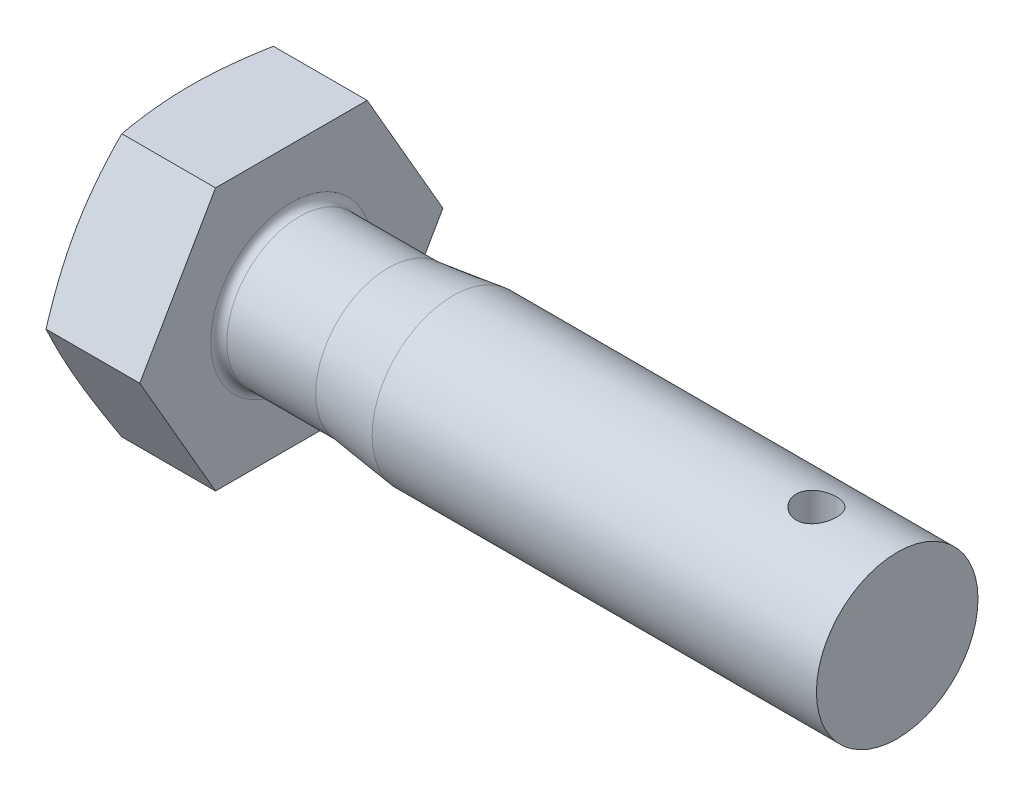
ISO-10303-21;
HEADER;
FILE_DESCRIPTION(('STEP AP214'),'2;1');
FILE_NAME('part.step','',(''),(''),'','','');
FILE_SCHEMA(('AUTOMOTIVE_DESIGN { 1 0 10303 214 1 1 1 1 }'));
ENDSEC;
DATA;
#1=APPLICATION_CONTEXT('core data for automotive mechanical design processes');
#2=APPLICATION_PROTOCOL_DEFINITION('international standard','automotive_design',2000,#1);
#3=PRODUCT_CONTEXT('',#1,'mechanical');
#4=PRODUCT('Part','Part','',(#3));
#5=PRODUCT_RELATED_PRODUCT_CATEGORY('part','',(#4));
#6=PRODUCT_DEFINITION_FORMATION('','',#4);
#7=PRODUCT_DEFINITION_CONTEXT('part definition',#1,'design');
#8=PRODUCT_DEFINITION('design','',#6,#7);
#9=PRODUCT_DEFINITION_SHAPE('','',#8);
#10=(LENGTH_UNIT() NAMED_UNIT(*) SI_UNIT(.MILLI.,.METRE.));
#11=(NAMED_UNIT(*) PLANE_ANGLE_UNIT() SI_UNIT($,.RADIAN.));
#12=(NAMED_UNIT(*) SI_UNIT($,.STERADIAN.) SOLID_ANGLE_UNIT());
#13=UNCERTAINTY_MEASURE_WITH_UNIT(LENGTH_MEASURE(1.E-05),#10,'distance_accuracy_value','');
#14=(GEOMETRIC_REPRESENTATION_CONTEXT(3) GLOBAL_UNCERTAINTY_ASSIGNED_CONTEXT((#13)) GLOBAL_UNIT_ASSIGNED_CONTEXT((#10,
#11,#12)) REPRESENTATION_CONTEXT('',''));
#15=CARTESIAN_POINT('',(0.,0.,0.));
#16=DIRECTION('',(0.,0.,1.));
#17=DIRECTION('',(1.,0.,0.));
#18=AXIS2_PLACEMENT_3D('',#15,#16,#17);
#19=CARTESIAN_POINT('',(0.,-6.49999999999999,-11.2583302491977));
#20=DIRECTION('',(1.,0.,0.));
#21=DIRECTION('',(0.,0.,-1.));
#22=AXIS2_PLACEMENT_3D('',#19,#20,#21);
#23=PLANE('',#22);
#24=CARTESIAN_POINT('',(0.,0.,0.));
#25=DIRECTION('',(-1.,0.,0.));
#26=DIRECTION('',(0.,0.,1.));
#27=AXIS2_PLACEMENT_3D('',#24,#25,#26);
#28=CIRCLE('',#27,5.7);
#29=CARTESIAN_POINT('',(0.,0.,5.7));
#30=VERTEX_POINT('',#29);
#31=EDGE_CURVE('E97',#30,#30,#28,.T.);
#32=ORIENTED_EDGE('',*,*,#31,.T.);
#33=EDGE_LOOP('',(#32));
#34=FACE_BOUND('',#33,.T.);
#35=CARTESIAN_POINT('',(0.,0.,0.));
#36=DIRECTION('',(1.,0.,0.));
#37=DIRECTION('',(0.,0.,-1.));
#38=AXIS2_PLACEMENT_3D('',#35,#36,#37);
#39=CIRCLE('',#38,4.6);
#40=CARTESIAN_POINT('',(0.,0.,-4.6));
#41=VERTEX_POINT('',#40);
#42=EDGE_CURVE('E230',#41,#41,#39,.T.);
#43=ORIENTED_EDGE('',*,*,#42,.T.);
#44=EDGE_LOOP('',(#43));
#45=FACE_BOUND('',#44,.T.);
#46=ADVANCED_FACE('F32',(#34,#45),#23,.F.);
#47=CARTESIAN_POINT('',(5.3,-6.5,3.75277674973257));
#48=DIRECTION('',(0.,1.,0.));
#49=DIRECTION('',(0.,0.,1.));
#50=AXIS2_PLACEMENT_3D('',#47,#48,#49);
#51=PLANE('',#50);
#52=CARTESIAN_POINT('',(2.23845243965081,-6.49999999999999,-9.90832031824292));
#53=CARTESIAN_POINT('',(2.14906495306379,-6.49999999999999,-9.61451823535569));
#54=CARTESIAN_POINT('',(2.06072666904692,-6.49999999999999,-9.32039096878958));
#55=CARTESIAN_POINT('',(1.88672902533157,-6.49999999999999,-8.73132057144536));
#56=CARTESIAN_POINT('',(1.80106987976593,-6.49999999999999,-8.43637737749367));
#57=CARTESIAN_POINT('',(1.63286685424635,-6.49999999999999,-7.84499875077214));
#58=CARTESIAN_POINT('',(1.55032916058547,-6.49999999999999,-7.54856155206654));
#59=CARTESIAN_POINT('',(1.38934256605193,-6.49999999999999,-6.95458050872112));
#60=CARTESIAN_POINT('',(1.31089359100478,-6.49999999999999,-6.65703668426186));
#61=CARTESIAN_POINT('',(1.16004648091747,-6.49999999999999,-6.06437621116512));
#62=CARTESIAN_POINT('',(1.08758490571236,-6.5,-5.76927579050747));
#63=CARTESIAN_POINT('',(0.948872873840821,-6.5,-5.17760339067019));
#64=CARTESIAN_POINT('',(0.882622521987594,-6.5,-4.88103138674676));
#65=CARTESIAN_POINT('',(0.757886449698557,-6.5,-4.28635449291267));
#66=CARTESIAN_POINT('',(0.699397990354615,-6.5,-3.98825018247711));
#67=CARTESIAN_POINT('',(0.591974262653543,-6.5,-3.39031237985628));
#68=CARTESIAN_POINT('',(0.543038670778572,-6.5,-3.09047894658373));
#69=CARTESIAN_POINT('',(0.461562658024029,-6.5,-2.52289407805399));
#70=CARTESIAN_POINT('',(0.427798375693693,-6.5,-2.25531997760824));
#71=CARTESIAN_POINT('',(0.370735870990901,-6.5,-1.71904882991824));
#72=CARTESIAN_POINT('',(0.347437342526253,-6.5,-1.45035181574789));
#73=CARTESIAN_POINT('',(0.312428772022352,-6.5,-0.912380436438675));
#74=CARTESIAN_POINT('',(0.300710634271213,-6.5,-0.643106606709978));
#75=CARTESIAN_POINT('',(0.289455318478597,-6.5,-0.104301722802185));
#76=CARTESIAN_POINT('',(0.289918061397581,-6.5,0.165229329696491));
#77=CARTESIAN_POINT('',(0.303033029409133,-6.5,0.705381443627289));
#78=CARTESIAN_POINT('',(0.315748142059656,-6.5,0.976000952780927));
#79=CARTESIAN_POINT('',(0.352783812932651,-6.5,1.51643777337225));
#80=CARTESIAN_POINT('',(0.377104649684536,-6.5,1.78625506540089));
#81=CARTESIAN_POINT('',(0.436219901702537,-6.5,2.32495734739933));
#82=CARTESIAN_POINT('',(0.471023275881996,-6.5,2.59384134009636));
#83=CARTESIAN_POINT('',(0.549699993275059,-6.5,3.13026390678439));
#84=CARTESIAN_POINT('',(0.593573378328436,-6.5,3.39780247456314));
#85=CARTESIAN_POINT('',(0.691934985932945,-6.5,3.94808111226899));
#86=CARTESIAN_POINT('',(0.74691338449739,-6.5,4.23073279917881));
#87=CARTESIAN_POINT('',(0.86394903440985,-6.5,4.79457620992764));
#88=CARTESIAN_POINT('',(0.926006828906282,-6.5,5.07576782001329));
#89=CARTESIAN_POINT('',(1.05588818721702,-6.5,5.63689575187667));
#90=CARTESIAN_POINT('',(1.12371345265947,-6.5,5.91683167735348));
#91=CARTESIAN_POINT('',(1.26402052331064,-6.5,6.47552108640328));
#92=CARTESIAN_POINT('',(1.33650221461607,-6.5,6.75427459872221));
#93=CARTESIAN_POINT('',(1.48534113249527,-6.5,7.31112718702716));
#94=CARTESIAN_POINT('',(1.56170324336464,-6.5,7.58922495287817));
#95=CARTESIAN_POINT('',(1.71752308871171,-6.5,8.14455350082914));
#96=CARTESIAN_POINT('',(1.79698086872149,-6.5,8.4217842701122));
#97=CARTESIAN_POINT('',(2.03910477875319,-6.5,9.25227183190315));
#98=CARTESIAN_POINT('',(2.20554932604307,-6.5,9.80442629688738));
#99=CARTESIAN_POINT('',(2.54338122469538,-6.5,10.9002631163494));
#100=CARTESIAN_POINT('',(2.7146898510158,-6.5,11.4439699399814));
#101=CARTESIAN_POINT('',(3.06213112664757,-6.5,12.5298660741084));
#102=CARTESIAN_POINT('',(3.23826401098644,-6.5,13.0720553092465));
#103=CARTESIAN_POINT('',(3.59337406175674,-6.5,14.1532106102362));
#104=CARTESIAN_POINT('',(3.77233783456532,-6.5,14.6921810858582));
#105=CARTESIAN_POINT('',(4.0427494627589,-6.5,15.4999530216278));
#106=CARTESIAN_POINT('',(4.13321063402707,-6.5,15.7690854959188));
#107=CARTESIAN_POINT('',(4.31471234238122,-6.5,16.3071543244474));
#108=CARTESIAN_POINT('',(4.40575287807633,-6.5,16.5760906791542));
#109=CARTESIAN_POINT('',(4.49704417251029,-6.5,16.8449418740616));
#110=B_SPLINE_CURVE_WITH_KNOTS('',3,(#52,#53,#54,#55,#56,#57,#58,#59,#60,#61,#62,#63,#64,#65,
#66,#67,#68,#69,#70,#71,#72,#73,#74,#75,#76,#77,#78,#79,#80,#81,#82,#83,#84,#85,#86,#87,#88,#89,
#90,#91,#92,#93,#94,#95,#96,#97,#98,#99,#100,#101,#102,#103,#104,#105,#106,#107,#108,#109),
.UNSPECIFIED.,.F.,.F.,(4,2,2,2,2,2,2,2,2,2,2,2,2,2,2,2,2,2,2,2,2,2,2,2,2,2,2,2,4),(0.,
0.921303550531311,1.84268054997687,2.76579693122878,3.68889656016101,4.60044337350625,
5.51200556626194,6.42324523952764,7.33445404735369,8.14336365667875,8.95224960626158,
9.76056967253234,10.5688844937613,11.3813703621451,12.1938757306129,13.0070774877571,
13.8202829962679,14.6840182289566,15.5478197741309,16.4118770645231,17.275913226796,
18.1410652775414,19.0062300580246,20.736241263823,22.4463828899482,24.1566079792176,
25.8603170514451,26.7121026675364,27.5638862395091),.UNSPECIFIED.);
#111=CARTESIAN_POINT('',(0.657167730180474,-6.5,-3.75277674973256));
#112=VERTEX_POINT('',#111);
#113=CARTESIAN_POINT('',(0.657167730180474,-6.5,3.75277674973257));
#114=VERTEX_POINT('',#113);
#115=EDGE_CURVE('E54',#112,#114,#110,.T.);
#116=ORIENTED_EDGE('',*,*,#115,.F.);
#117=DIRECTION('',(-1.,0.,0.));
#118=VECTOR('',#117,1.);
#119=CARTESIAN_POINT('',(5.3,-6.5,-3.75277674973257));
#120=LINE('',#119,#118);
#121=CARTESIAN_POINT('',(5.3,-6.5,-3.75277674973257));
#122=VERTEX_POINT('',#121);
#123=EDGE_CURVE('E122',#122,#112,#120,.T.);
#124=ORIENTED_EDGE('',*,*,#123,.F.);
#125=DIRECTION('',(0.,0.,-1.));
#126=VECTOR('',#125,1.);
#127=CARTESIAN_POINT('',(5.3,-6.5,3.75277674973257));
#128=LINE('',#127,#126);
#129=CARTESIAN_POINT('',(5.3,-6.5,3.75277674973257));
#130=VERTEX_POINT('',#129);
#131=EDGE_CURVE('E259',#130,#122,#128,.T.);
#132=ORIENTED_EDGE('',*,*,#131,.F.);
#133=DIRECTION('',(-1.,0.,0.));
#134=VECTOR('',#133,1.);
#135=CARTESIAN_POINT('',(5.3,-6.5,3.75277674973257));
#136=LINE('',#135,#134);
#137=EDGE_CURVE('E110',#130,#114,#136,.T.);
#138=ORIENTED_EDGE('',*,*,#137,.T.);
#139=EDGE_LOOP('',(#116,#124,#132,#138));
#140=FACE_BOUND('',#139,.T.);
#141=ADVANCED_FACE('F34',(#140),#51,.F.);
#142=CARTESIAN_POINT('',(5.3,-6.5,-3.75277674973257));
#143=DIRECTION('',(0.,0.5,0.866025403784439));
#144=DIRECTION('',(0.,-0.866025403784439,0.5));
#145=AXIS2_PLACEMENT_3D('',#142,#143,#144);
#146=PLANE('',#145);
#147=CARTESIAN_POINT('',(0.657209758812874,0.000200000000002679,-7.50566896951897));
#148=CARTESIAN_POINT('',(0.600620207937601,-0.268995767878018,-7.35024872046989));
#149=CARTESIAN_POINT('',(0.549142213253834,-0.539079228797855,-7.19431596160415));
#150=CARTESIAN_POINT('',(0.458574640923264,-1.08100226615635,-6.88143655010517));
#151=CARTESIAN_POINT('',(0.419494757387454,-1.35284304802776,-6.72448920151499));
#152=CARTESIAN_POINT('',(0.356284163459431,-1.89526390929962,-6.41132237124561));
#153=CARTESIAN_POINT('',(0.332015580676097,-2.16583160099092,-6.25511004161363));
#154=CARTESIAN_POINT('',(0.29946458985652,-2.7075997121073,-5.94232007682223));
#155=CARTESIAN_POINT('',(0.291176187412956,-2.97879985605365,-5.78574260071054));
#156=CARTESIAN_POINT('',(0.291176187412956,-3.52120014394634,-5.47258764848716));
#157=CARTESIAN_POINT('',(0.29946458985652,-3.79240028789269,-5.31601017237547));
#158=CARTESIAN_POINT('',(0.332015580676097,-4.33416839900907,-5.00322020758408));
#159=CARTESIAN_POINT('',(0.35628416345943,-4.60473609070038,-4.84700787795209));
#160=CARTESIAN_POINT('',(0.419494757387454,-5.14715695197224,-4.53384104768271));
#161=CARTESIAN_POINT('',(0.458574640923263,-5.41899773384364,-4.37689369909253));
#162=CARTESIAN_POINT('',(0.549142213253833,-5.96092077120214,-4.06401428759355));
#163=CARTESIAN_POINT('',(0.6006202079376,-6.23100423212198,-3.90808152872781));
#164=CARTESIAN_POINT('',(0.657209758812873,-6.5002,-3.75266127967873));
#165=B_SPLINE_CURVE_WITH_KNOTS('',3,(#147,#148,#149,#150,#151,#152,#153,#154,#155,#156,#157,
#158,#159,#160,#161,#162,#163,#164),.UNSPECIFIED.,.F.,.F.,(4,2,2,2,2,2,2,2,4),(0.,
0.947946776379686,1.89663293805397,2.83634783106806,3.77571015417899,4.71507247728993,
5.65478737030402,6.6034735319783,7.55142030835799),.UNSPECIFIED.);
#166=CARTESIAN_POINT('',(0.657167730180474,0.,-7.50555349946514));
#167=VERTEX_POINT('',#166);
#168=EDGE_CURVE('E192',#167,#112,#165,.T.);
#169=ORIENTED_EDGE('',*,*,#168,.F.);
#170=DIRECTION('',(-1.,0.,0.));
#171=VECTOR('',#170,1.);
#172=CARTESIAN_POINT('',(5.3,0.,-7.50555349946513));
#173=LINE('',#172,#171);
#174=CARTESIAN_POINT('',(5.3,0.,-7.50555349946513));
#175=VERTEX_POINT('',#174);
#176=EDGE_CURVE('E119',#175,#167,#173,.T.);
#177=ORIENTED_EDGE('',*,*,#176,.F.);
#178=DIRECTION('',(0.,0.866025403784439,-0.5));
#179=VECTOR('',#178,1.);
#180=CARTESIAN_POINT('',(5.3,-6.5,-3.75277674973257));
#181=LINE('',#180,#179);
#182=EDGE_CURVE('E260',#122,#175,#181,.T.);
#183=ORIENTED_EDGE('',*,*,#182,.F.);
#184=ORIENTED_EDGE('',*,*,#123,.T.);
#185=EDGE_LOOP('',(#169,#177,#183,#184));
#186=FACE_BOUND('',#185,.T.);
#187=ADVANCED_FACE('F200',(#186),#146,.F.);
#188=CARTESIAN_POINT('',(5.3,0.,-7.50555349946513));
#189=DIRECTION('',(0.,-0.5,0.866025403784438));
#190=DIRECTION('',(0.,-0.866025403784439,-0.5));
#191=AXIS2_PLACEMENT_3D('',#188,#189,#190);
#192=PLANE('',#191);
#193=CARTESIAN_POINT('',(0.657209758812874,6.5002,-3.75266127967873));
#194=CARTESIAN_POINT('',(0.600620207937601,6.23100423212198,-3.90808152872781));
#195=CARTESIAN_POINT('',(0.549142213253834,5.96092077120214,-4.06401428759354));
#196=CARTESIAN_POINT('',(0.458574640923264,5.41899773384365,-4.37689369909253));
#197=CARTESIAN_POINT('',(0.419494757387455,5.14715695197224,-4.53384104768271));
#198=CARTESIAN_POINT('',(0.356284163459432,4.60473609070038,-4.84700787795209));
#199=CARTESIAN_POINT('',(0.332015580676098,4.33416839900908,-5.00322020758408));
#200=CARTESIAN_POINT('',(0.29946458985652,3.7924002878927,-5.31601017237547));
#201=CARTESIAN_POINT('',(0.291176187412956,3.52120014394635,-5.47258764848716));
#202=CARTESIAN_POINT('',(0.291176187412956,2.97879985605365,-5.78574260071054));
#203=CARTESIAN_POINT('',(0.29946458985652,2.70759971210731,-5.94232007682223));
#204=CARTESIAN_POINT('',(0.332015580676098,2.16583160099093,-6.25511004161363));
#205=CARTESIAN_POINT('',(0.356284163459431,1.89526390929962,-6.41132237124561));
#206=CARTESIAN_POINT('',(0.419494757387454,1.35284304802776,-6.72448920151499));
#207=CARTESIAN_POINT('',(0.458574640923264,1.08100226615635,-6.88143655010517));
#208=CARTESIAN_POINT('',(0.549142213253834,0.539079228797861,-7.19431596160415));
#209=CARTESIAN_POINT('',(0.600620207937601,0.268995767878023,-7.35024872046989));
#210=CARTESIAN_POINT('',(0.657209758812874,-0.000199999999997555,-7.50566896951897));
#211=B_SPLINE_CURVE_WITH_KNOTS('',3,(#193,#194,#195,#196,#197,#198,#199,#200,#201,#202,#203,
#204,#205,#206,#207,#208,#209,#210),.UNSPECIFIED.,.F.,.F.,(4,2,2,2,2,2,2,2,4),(0.,
0.947946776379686,1.89663293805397,2.83634783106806,3.77571015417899,4.71507247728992,
5.65478737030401,6.6034735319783,7.55142030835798),.UNSPECIFIED.);
#212=CARTESIAN_POINT('',(0.657167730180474,6.5,-3.75277674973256));
#213=VERTEX_POINT('',#212);
#214=EDGE_CURVE('E186',#213,#167,#211,.T.);
#215=ORIENTED_EDGE('',*,*,#214,.F.);
#216=DIRECTION('',(-1.,0.,0.));
#217=VECTOR('',#216,1.);
#218=CARTESIAN_POINT('',(5.3,6.5,-3.75277674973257));
#219=LINE('',#218,#217);
#220=CARTESIAN_POINT('',(5.3,6.5,-3.75277674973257));
#221=VERTEX_POINT('',#220);
#222=EDGE_CURVE('E112',#221,#213,#219,.T.);
#223=ORIENTED_EDGE('',*,*,#222,.F.);
#224=DIRECTION('',(0.,0.866025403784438,0.5));
#225=VECTOR('',#224,1.);
#226=CARTESIAN_POINT('',(5.3,0.,-7.50555349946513));
#227=LINE('',#226,#225);
#228=EDGE_CURVE('E264',#175,#221,#227,.T.);
#229=ORIENTED_EDGE('',*,*,#228,.F.);
#230=ORIENTED_EDGE('',*,*,#176,.T.);
#231=EDGE_LOOP('',(#215,#223,#229,#230));
#232=FACE_BOUND('',#231,.T.);
#233=ADVANCED_FACE('F203',(#232),#192,.F.);
#234=CARTESIAN_POINT('',(5.3,6.5,-3.75277674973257));
#235=DIRECTION('',(0.,-1.,0.));
#236=DIRECTION('',(0.,0.,-1.));
#237=AXIS2_PLACEMENT_3D('',#234,#235,#236);
#238=PLANE('',#237);
#239=CARTESIAN_POINT('',(2.23845243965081,6.5,-9.90832031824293));
#240=CARTESIAN_POINT('',(2.14906495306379,6.5,-9.6145182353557));
#241=CARTESIAN_POINT('',(2.06072666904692,6.5,-9.32039096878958));
#242=CARTESIAN_POINT('',(1.88672902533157,6.5,-8.73132057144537));
#243=CARTESIAN_POINT('',(1.80106987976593,6.5,-8.43637737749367));
#244=CARTESIAN_POINT('',(1.63286685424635,6.5,-7.84499875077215));
#245=CARTESIAN_POINT('',(1.55032916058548,6.5,-7.54856155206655));
#246=CARTESIAN_POINT('',(1.38934256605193,6.5,-6.95458050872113));
#247=CARTESIAN_POINT('',(1.31089359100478,6.5,-6.65703668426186));
#248=CARTESIAN_POINT('',(1.16004648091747,6.5,-6.06437621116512));
#249=CARTESIAN_POINT('',(1.08758490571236,6.5,-5.76927579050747));
#250=CARTESIAN_POINT('',(0.948872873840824,6.5,-5.17760339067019));
#251=CARTESIAN_POINT('',(0.882622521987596,6.5,-4.88103138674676));
#252=CARTESIAN_POINT('',(0.757886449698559,6.5,-4.28635449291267));
#253=CARTESIAN_POINT('',(0.699397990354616,6.5,-3.98825018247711));
#254=CARTESIAN_POINT('',(0.591974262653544,6.5,-3.39031237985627));
#255=CARTESIAN_POINT('',(0.543038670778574,6.5,-3.09047894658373));
#256=CARTESIAN_POINT('',(0.46156265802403,6.5,-2.52289407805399));
#257=CARTESIAN_POINT('',(0.427798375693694,6.5,-2.25531997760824));
#258=CARTESIAN_POINT('',(0.370735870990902,6.5,-1.71904882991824));
#259=CARTESIAN_POINT('',(0.347437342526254,6.5,-1.45035181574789));
#260=CARTESIAN_POINT('',(0.312428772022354,6.5,-0.912380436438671));
#261=CARTESIAN_POINT('',(0.300710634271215,6.5,-0.643106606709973));
#262=CARTESIAN_POINT('',(0.289455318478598,6.5,-0.104301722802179));
#263=CARTESIAN_POINT('',(0.289918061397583,6.5,0.165229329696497));
#264=CARTESIAN_POINT('',(0.303033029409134,6.5,0.705381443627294));
#265=CARTESIAN_POINT('',(0.315748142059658,6.5,0.976000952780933));
#266=CARTESIAN_POINT('',(0.352783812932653,6.5,1.51643777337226));
#267=CARTESIAN_POINT('',(0.377104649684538,6.5,1.78625506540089));
#268=CARTESIAN_POINT('',(0.436219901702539,6.5,2.32495734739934));
#269=CARTESIAN_POINT('',(0.471023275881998,6.5,2.59384134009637));
#270=CARTESIAN_POINT('',(0.549699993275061,6.5,3.1302639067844));
#271=CARTESIAN_POINT('',(0.593573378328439,6.5,3.39780247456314));
#272=CARTESIAN_POINT('',(0.691934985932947,6.5,3.948081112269));
#273=CARTESIAN_POINT('',(0.746913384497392,6.5,4.23073279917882));
#274=CARTESIAN_POINT('',(0.863949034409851,6.5,4.79457620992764));
#275=CARTESIAN_POINT('',(0.926006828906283,6.5,5.07576782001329));
#276=CARTESIAN_POINT('',(1.05588818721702,6.5,5.63689575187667));
#277=CARTESIAN_POINT('',(1.12371345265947,6.5,5.91683167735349));
#278=CARTESIAN_POINT('',(1.26402052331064,6.5,6.47552108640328));
#279=CARTESIAN_POINT('',(1.33650221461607,6.5,6.75427459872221));
#280=CARTESIAN_POINT('',(1.48534113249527,6.5,7.31112718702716));
#281=CARTESIAN_POINT('',(1.56170324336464,6.5,7.58922495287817));
#282=CARTESIAN_POINT('',(1.71752308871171,6.5,8.14455350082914));
#283=CARTESIAN_POINT('',(1.7969808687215,6.5,8.42178427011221));
#284=CARTESIAN_POINT('',(2.03910477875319,6.5,9.25227183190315));
#285=CARTESIAN_POINT('',(2.20554932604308,6.5,9.80442629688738));
#286=CARTESIAN_POINT('',(2.54338122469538,6.5,10.9002631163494));
#287=CARTESIAN_POINT('',(2.7146898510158,6.5,11.4439699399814));
#288=CARTESIAN_POINT('',(3.06213112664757,6.5,12.5298660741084));
#289=CARTESIAN_POINT('',(3.23826401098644,6.5,13.0720553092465));
#290=CARTESIAN_POINT('',(3.59337406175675,6.5,14.1532106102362));
#291=CARTESIAN_POINT('',(3.77233783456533,6.5,14.6921810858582));
#292=CARTESIAN_POINT('',(4.0427494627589,6.5,15.4999530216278));
#293=CARTESIAN_POINT('',(4.13321063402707,6.5,15.7690854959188));
#294=CARTESIAN_POINT('',(4.31471234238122,6.5,16.3071543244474));
#295=CARTESIAN_POINT('',(4.40575287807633,6.5,16.5760906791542));
#296=CARTESIAN_POINT('',(4.49704417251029,6.5,16.8449418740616));
#297=B_SPLINE_CURVE_WITH_KNOTS('',3,(#239,#240,#241,#242,#243,#244,#245,#246,#247,#248,#249,
#250,#251,#252,#253,#254,#255,#256,#257,#258,#259,#260,#261,#262,#263,#264,#265,#266,#267,#268,
#269,#270,#271,#272,#273,#274,#275,#276,#277,#278,#279,#280,#281,#282,#283,#284,#285,#286,#287,
#288,#289,#290,#291,#292,#293,#294,#295,#296),.UNSPECIFIED.,.F.,.F.,(4,2,2,2,2,2,2,2,2,2,2,2,2,
2,2,2,2,2,2,2,2,2,2,2,2,2,2,2,4),(0.,0.921303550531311,1.84268054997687,2.76579693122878,
3.68889656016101,4.60044337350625,5.51200556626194,6.42324523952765,7.3344540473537,
8.14336365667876,8.95224960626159,9.76056967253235,10.5688844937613,11.3813703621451,
12.1938757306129,13.0070774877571,13.820282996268,14.6840182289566,15.5478197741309,
16.4118770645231,17.275913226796,18.1410652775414,19.0062300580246,20.736241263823,
22.4463828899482,24.1566079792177,25.8603170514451,26.7121026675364,27.5638862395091),.UNSPECIFIED.);
#298=CARTESIAN_POINT('',(0.657167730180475,6.5,3.75277674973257));
#299=VERTEX_POINT('',#298);
#300=EDGE_CURVE('E107',#299,#213,#297,.F.);
#301=ORIENTED_EDGE('',*,*,#300,.F.);
#302=DIRECTION('',(-1.,0.,0.));
#303=VECTOR('',#302,1.);
#304=CARTESIAN_POINT('',(5.3,6.5,3.75277674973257));
#305=LINE('',#304,#303);
#306=CARTESIAN_POINT('',(5.3,6.5,3.75277674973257));
#307=VERTEX_POINT('',#306);
#308=EDGE_CURVE('E106',#307,#299,#305,.T.);
#309=ORIENTED_EDGE('',*,*,#308,.F.);
#310=DIRECTION('',(0.,0.,1.));
#311=VECTOR('',#310,1.);
#312=CARTESIAN_POINT('',(5.3,6.5,-3.75277674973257));
#313=LINE('',#312,#311);
#314=EDGE_CURVE('E266',#221,#307,#313,.T.);
#315=ORIENTED_EDGE('',*,*,#314,.F.);
#316=ORIENTED_EDGE('',*,*,#222,.T.);
#317=EDGE_LOOP('',(#301,#309,#315,#316));
#318=FACE_BOUND('',#317,.T.);
#319=ADVANCED_FACE('F207',(#318),#238,.F.);
#320=CARTESIAN_POINT('',(5.3,6.5,3.75277674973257));
#321=DIRECTION('',(0.,-0.5,-0.866025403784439));
#322=DIRECTION('',(0.,0.866025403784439,-0.5));
#323=AXIS2_PLACEMENT_3D('',#320,#321,#322);
#324=PLANE('',#323);
#325=CARTESIAN_POINT('',(0.657209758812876,-0.000199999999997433,7.50566896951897));
#326=CARTESIAN_POINT('',(0.600620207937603,0.268995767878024,7.35024872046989));
#327=CARTESIAN_POINT('',(0.549142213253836,0.539079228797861,7.19431596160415));
#328=CARTESIAN_POINT('',(0.458574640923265,1.08100226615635,6.88143655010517));
#329=CARTESIAN_POINT('',(0.419494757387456,1.35284304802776,6.72448920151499));
#330=CARTESIAN_POINT('',(0.356284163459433,1.89526390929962,6.41132237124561));
#331=CARTESIAN_POINT('',(0.3320155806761,2.16583160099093,6.25511004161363));
#332=CARTESIAN_POINT('',(0.299464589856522,2.70759971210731,5.94232007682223));
#333=CARTESIAN_POINT('',(0.291176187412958,2.97879985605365,5.78574260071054));
#334=CARTESIAN_POINT('',(0.291176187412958,3.52120014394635,5.47258764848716));
#335=CARTESIAN_POINT('',(0.299464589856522,3.7924002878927,5.31601017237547));
#336=CARTESIAN_POINT('',(0.3320155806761,4.33416839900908,5.00322020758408));
#337=CARTESIAN_POINT('',(0.356284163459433,4.60473609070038,4.84700787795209));
#338=CARTESIAN_POINT('',(0.419494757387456,5.14715695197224,4.53384104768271));
#339=CARTESIAN_POINT('',(0.458574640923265,5.41899773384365,4.37689369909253));
#340=CARTESIAN_POINT('',(0.549142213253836,5.96092077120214,4.06401428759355));
#341=CARTESIAN_POINT('',(0.600620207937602,6.23100423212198,3.90808152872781));
#342=CARTESIAN_POINT('',(0.657209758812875,6.5002,3.75266127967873));
#343=B_SPLINE_CURVE_WITH_KNOTS('',3,(#325,#326,#327,#328,#329,#330,#331,#332,#333,#334,#335,
#336,#337,#338,#339,#340,#341,#342),.UNSPECIFIED.,.F.,.F.,(4,2,2,2,2,2,2,2,4),(0.,
0.947946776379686,1.89663293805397,2.83634783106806,3.77571015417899,4.71507247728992,
5.65478737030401,6.6034735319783,7.55142030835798),.UNSPECIFIED.);
#344=CARTESIAN_POINT('',(0.657167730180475,0.,7.50555349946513));
#345=VERTEX_POINT('',#344);
#346=EDGE_CURVE('E92',#345,#299,#343,.T.);
#347=ORIENTED_EDGE('',*,*,#346,.F.);
#348=DIRECTION('',(-1.,0.,0.));
#349=VECTOR('',#348,1.);
#350=CARTESIAN_POINT('',(5.3,0.,7.50555349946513));
#351=LINE('',#350,#349);
#352=CARTESIAN_POINT('',(5.3,0.,7.50555349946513));
#353=VERTEX_POINT('',#352);
#354=EDGE_CURVE('E104',#353,#345,#351,.T.);
#355=ORIENTED_EDGE('',*,*,#354,.F.);
#356=DIRECTION('',(0.,-0.866025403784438,0.5));
#357=VECTOR('',#356,1.);
#358=CARTESIAN_POINT('',(5.3,6.5,3.75277674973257));
#359=LINE('',#358,#357);
#360=EDGE_CURVE('E268',#307,#353,#359,.T.);
#361=ORIENTED_EDGE('',*,*,#360,.F.);
#362=ORIENTED_EDGE('',*,*,#308,.T.);
#363=EDGE_LOOP('',(#347,#355,#361,#362));
#364=FACE_BOUND('',#363,.T.);
#365=ADVANCED_FACE('F102',(#364),#324,.F.);
#366=CARTESIAN_POINT('',(5.3,0.,7.50555349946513));
#367=DIRECTION('',(0.,0.5,-0.866025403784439));
#368=DIRECTION('',(0.,0.866025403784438,0.5));
#369=AXIS2_PLACEMENT_3D('',#366,#367,#368);
#370=PLANE('',#369);
#371=CARTESIAN_POINT('',(0.657209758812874,-6.5002,3.75266127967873));
#372=CARTESIAN_POINT('',(0.600620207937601,-6.23100423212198,3.90808152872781));
#373=CARTESIAN_POINT('',(0.549142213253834,-5.96092077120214,4.06401428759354));
#374=CARTESIAN_POINT('',(0.458574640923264,-5.41899773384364,4.37689369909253));
#375=CARTESIAN_POINT('',(0.419494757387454,-5.14715695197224,4.53384104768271));
#376=CARTESIAN_POINT('',(0.356284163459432,-4.60473609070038,4.84700787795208));
#377=CARTESIAN_POINT('',(0.332015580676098,-4.33416839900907,5.00322020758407));
#378=CARTESIAN_POINT('',(0.299464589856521,-3.79240028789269,5.31601017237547));
#379=CARTESIAN_POINT('',(0.291176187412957,-3.52120014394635,5.47258764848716));
#380=CARTESIAN_POINT('',(0.291176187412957,-2.97879985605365,5.78574260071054));
#381=CARTESIAN_POINT('',(0.299464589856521,-2.7075997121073,5.94232007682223));
#382=CARTESIAN_POINT('',(0.332015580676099,-2.16583160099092,6.25511004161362));
#383=CARTESIAN_POINT('',(0.356284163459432,-1.89526390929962,6.41132237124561));
#384=CARTESIAN_POINT('',(0.419494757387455,-1.35284304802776,6.72448920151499));
#385=CARTESIAN_POINT('',(0.458574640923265,-1.08100226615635,6.88143655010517));
#386=CARTESIAN_POINT('',(0.549142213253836,-0.539079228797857,7.19431596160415));
#387=CARTESIAN_POINT('',(0.600620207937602,-0.268995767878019,7.35024872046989));
#388=CARTESIAN_POINT('',(0.657209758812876,0.000200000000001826,7.50566896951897));
#389=B_SPLINE_CURVE_WITH_KNOTS('',3,(#371,#372,#373,#374,#375,#376,#377,#378,#379,#380,#381,
#382,#383,#384,#385,#386,#387,#388),.UNSPECIFIED.,.F.,.F.,(4,2,2,2,2,2,2,2,4),(0.,
0.947946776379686,1.89663293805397,2.83634783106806,3.77571015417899,4.71507247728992,
5.65478737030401,6.6034735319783,7.55142030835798),.UNSPECIFIED.);
#390=EDGE_CURVE('E89',#114,#345,#389,.T.);
#391=ORIENTED_EDGE('',*,*,#390,.F.);
#392=ORIENTED_EDGE('',*,*,#137,.F.);
#393=DIRECTION('',(0.,-0.866025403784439,-0.5));
#394=VECTOR('',#393,1.);
#395=CARTESIAN_POINT('',(5.3,0.,7.50555349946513));
#396=LINE('',#395,#394);
#397=EDGE_CURVE('E62',#353,#130,#396,.T.);
#398=ORIENTED_EDGE('',*,*,#397,.F.);
#399=ORIENTED_EDGE('',*,*,#354,.T.);
#400=EDGE_LOOP('',(#391,#392,#398,#399));
#401=FACE_BOUND('',#400,.T.);
#402=ADVANCED_FACE('F109',(#401),#370,.F.);
#403=CARTESIAN_POINT('',(5.3,-6.49999999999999,-11.2583302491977));
#404=DIRECTION('',(1.,0.,0.));
#405=DIRECTION('',(0.,0.,-1.));
#406=AXIS2_PLACEMENT_3D('',#403,#404,#405);
#407=PLANE('',#406);
#408=CARTESIAN_POINT('',(5.3,0.,0.));
#409=DIRECTION('',(1.,0.,0.));
#410=DIRECTION('',(0.,0.,-1.));
#411=AXIS2_PLACEMENT_3D('',#408,#409,#410);
#412=CIRCLE('',#411,3.994);
#413=CARTESIAN_POINT('',(5.3,0.,-3.994));
#414=VERTEX_POINT('',#413);
#415=EDGE_CURVE('E46',#414,#414,#412,.F.);
#416=ORIENTED_EDGE('',*,*,#415,.T.);
#417=EDGE_LOOP('',(#416));
#418=FACE_BOUND('',#417,.T.);
#419=ORIENTED_EDGE('',*,*,#131,.T.);
#420=ORIENTED_EDGE('',*,*,#182,.T.);
#421=ORIENTED_EDGE('',*,*,#228,.T.);
#422=ORIENTED_EDGE('',*,*,#314,.T.);
#423=ORIENTED_EDGE('',*,*,#360,.T.);
#424=ORIENTED_EDGE('',*,*,#397,.T.);
#425=EDGE_LOOP('',(#419,#420,#421,#422,#423,#424));
#426=FACE_BOUND('',#425,.T.);
#427=ADVANCED_FACE('F163',(#418,#426),#407,.T.);
#428=CARTESIAN_POINT('',(0.,0.,0.));
#429=DIRECTION('',(1.,0.,0.));
#430=DIRECTION('',(0.,0.,-1.));
#431=AXIS2_PLACEMENT_3D('',#428,#429,#430);
#432=CONICAL_SURFACE('',#431,5.7,1.22173047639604);
#433=ORIENTED_EDGE('',*,*,#31,.F.);
#434=EDGE_LOOP('',(#433));
#435=FACE_BOUND('',#434,.T.);
#436=ORIENTED_EDGE('',*,*,#115,.T.);
#437=ORIENTED_EDGE('',*,*,#390,.T.);
#438=ORIENTED_EDGE('',*,*,#346,.T.);
#439=ORIENTED_EDGE('',*,*,#300,.T.);
#440=ORIENTED_EDGE('',*,*,#214,.T.);
#441=ORIENTED_EDGE('',*,*,#168,.T.);
#442=EDGE_LOOP('',(#436,#437,#438,#439,#440,#441));
#443=FACE_BOUND('',#442,.T.);
#444=ADVANCED_FACE('F91',(#435,#443),#432,.T.);
#445=CARTESIAN_POINT('',(1.06,0.,0.));
#446=DIRECTION('',(-1.,0.,0.));
#447=DIRECTION('',(0.,0.,1.));
#448=AXIS2_PLACEMENT_3D('',#445,#446,#447);
#449=CYLINDRICAL_SURFACE('',#448,4.6);
#450=CARTESIAN_POINT('',(1.06,0.,0.));
#451=DIRECTION('',(1.,0.,0.));
#452=DIRECTION('',(0.,0.,-1.));
#453=AXIS2_PLACEMENT_3D('',#450,#451,#452);
#454=CIRCLE('',#453,4.6);
#455=CARTESIAN_POINT('',(1.06,0.,-4.6));
#456=VERTEX_POINT('',#455);
#457=EDGE_CURVE('E232',#456,#456,#454,.T.);
#458=ORIENTED_EDGE('',*,*,#457,.T.);
#459=EDGE_LOOP('',(#458));
#460=FACE_BOUND('',#459,.T.);
#461=ORIENTED_EDGE('',*,*,#42,.F.);
#462=EDGE_LOOP('',(#461));
#463=FACE_BOUND('',#462,.T.);
#464=ADVANCED_FACE('F156',(#460,#463),#449,.F.);
#465=CARTESIAN_POINT('',(1.06,0.,0.));
#466=DIRECTION('',(1.,0.,0.));
#467=DIRECTION('',(0.,0.,-1.));
#468=AXIS2_PLACEMENT_3D('',#465,#466,#467);
#469=PLANE('',#468);
#470=ORIENTED_EDGE('',*,*,#457,.F.);
#471=EDGE_LOOP('',(#470));
#472=FACE_BOUND('',#471,.T.);
#473=ADVANCED_FACE('F152',(#472),#469,.F.);
#474=CARTESIAN_POINT('',(10.1,0.,0.));
#475=DIRECTION('',(1.,0.,0.));
#476=DIRECTION('',(0.,0.,-1.));
#477=AXIS2_PLACEMENT_3D('',#474,#475,#476);
#478=CONICAL_SURFACE('',#477,3.594,0.126200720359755);
#479=CARTESIAN_POINT('',(13.3,0.,0.));
#480=DIRECTION('',(-1.,0.,0.));
#481=DIRECTION('',(0.,0.,1.));
#482=AXIS2_PLACEMENT_3D('',#479,#480,#481);
#483=CIRCLE('',#482,4.);
#484=CARTESIAN_POINT('',(13.3,0.,4.));
#485=VERTEX_POINT('',#484);
#486=EDGE_CURVE('E233',#485,#485,#483,.T.);
#487=ORIENTED_EDGE('',*,*,#486,.T.);
#488=EDGE_LOOP('',(#487));
#489=FACE_BOUND('',#488,.T.);
#490=CARTESIAN_POINT('',(10.1,0.,0.));
#491=DIRECTION('',(-1.,0.,0.));
#492=DIRECTION('',(0.,0.,1.));
#493=AXIS2_PLACEMENT_3D('',#490,#491,#492);
#494=CIRCLE('',#493,3.594);
#495=CARTESIAN_POINT('',(10.1,0.,3.594));
#496=VERTEX_POINT('',#495);
#497=EDGE_CURVE('E238',#496,#496,#494,.T.);
#498=ORIENTED_EDGE('',*,*,#497,.F.);
#499=EDGE_LOOP('',(#498));
#500=FACE_BOUND('',#499,.T.);
#501=ADVANCED_FACE('F148',(#489,#500),#478,.T.);
#502=CARTESIAN_POINT('',(0.,0.,0.));
#503=DIRECTION('',(-1.,0.,0.));
#504=DIRECTION('',(0.,0.,1.));
#505=AXIS2_PLACEMENT_3D('',#502,#503,#504);
#506=CYLINDRICAL_SURFACE('',#505,3.594);
#507=CARTESIAN_POINT('',(5.7,0.,0.));
#508=DIRECTION('',(1.,0.,0.));
#509=DIRECTION('',(0.,0.,-1.));
#510=AXIS2_PLACEMENT_3D('',#507,#508,#509);
#511=CIRCLE('',#510,3.594);
#512=CARTESIAN_POINT('',(5.7,0.,-3.594));
#513=VERTEX_POINT('',#512);
#514=EDGE_CURVE('E11',#513,#513,#511,.T.);
#515=ORIENTED_EDGE('',*,*,#514,.T.);
#516=EDGE_LOOP('',(#515));
#517=FACE_BOUND('',#516,.T.);
#518=ORIENTED_EDGE('',*,*,#497,.T.);
#519=EDGE_LOOP('',(#518));
#520=FACE_BOUND('',#519,.T.);
#521=ADVANCED_FACE('F144',(#517,#520),#506,.T.);
#522=CARTESIAN_POINT('',(35.3,0.,0.));
#523=DIRECTION('',(1.,0.,0.));
#524=DIRECTION('',(0.,0.,-1.));
#525=AXIS2_PLACEMENT_3D('',#522,#523,#524);
#526=PLANE('',#525);
#527=CARTESIAN_POINT('',(35.3,0.,0.));
#528=DIRECTION('',(1.,0.,0.));
#529=DIRECTION('',(0.,0.,-1.));
#530=AXIS2_PLACEMENT_3D('',#527,#528,#529);
#531=CIRCLE('',#530,4.);
#532=CARTESIAN_POINT('',(35.3,0.,-4.));
#533=VERTEX_POINT('',#532);
#534=EDGE_CURVE('E255',#533,#533,#531,.T.);
#535=ORIENTED_EDGE('',*,*,#534,.T.);
#536=EDGE_LOOP('',(#535));
#537=FACE_BOUND('',#536,.T.);
#538=ADVANCED_FACE('F147',(#537),#526,.T.);
#539=CARTESIAN_POINT('',(35.3,0.,0.));
#540=DIRECTION('',(-1.,0.,0.));
#541=DIRECTION('',(0.,0.,1.));
#542=AXIS2_PLACEMENT_3D('',#539,#540,#541);
#543=CYLINDRICAL_SURFACE('',#542,4.);
#544=CARTESIAN_POINT('',(31.3,-3.87298334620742,0.999999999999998));
#545=CARTESIAN_POINT('',(31.3552203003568,-3.87298440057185,0.999998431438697));
#546=CARTESIAN_POINT('',(31.4104579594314,-3.87417722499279,0.995410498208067));
#547=CARTESIAN_POINT('',(31.5193470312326,-3.87880744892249,0.977209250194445));
#548=CARTESIAN_POINT('',(31.57299750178,-3.88224615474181,0.963590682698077));
#549=CARTESIAN_POINT('',(31.6771214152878,-3.89095489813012,0.927796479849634));
#550=CARTESIAN_POINT('',(31.7275988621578,-3.8962225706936,0.905631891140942));
#551=CARTESIAN_POINT('',(31.8241243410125,-3.90799276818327,0.853408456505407));
#552=CARTESIAN_POINT('',(31.8701721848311,-3.91449534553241,0.823349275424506));
#553=CARTESIAN_POINT('',(31.9575446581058,-3.92816286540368,0.755483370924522));
#554=CARTESIAN_POINT('',(31.9987574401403,-3.93533839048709,0.717534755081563));
#555=CARTESIAN_POINT('',(32.0743045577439,-3.94945150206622,0.635272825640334));
#556=CARTESIAN_POINT('',(32.1086382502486,-3.95638906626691,0.590958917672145));
#557=CARTESIAN_POINT('',(32.1699101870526,-3.96936166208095,0.496458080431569));
#558=CARTESIAN_POINT('',(32.1967385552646,-3.975382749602,0.446197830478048));
#559=CARTESIAN_POINT('',(32.2415238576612,-3.9857232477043,0.341705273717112));
#560=CARTESIAN_POINT('',(32.2594821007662,-3.99004290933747,0.287473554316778));
#561=CARTESIAN_POINT('',(32.2856591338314,-3.99641903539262,0.177743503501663));
#562=CARTESIAN_POINT('',(32.2940678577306,-3.99851957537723,0.12229308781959));
#563=CARTESIAN_POINT('',(32.3015033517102,-4.00037437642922,0.0107315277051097));
#564=CARTESIAN_POINT('',(32.3005315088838,-4.00012898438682,-0.0453795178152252));
#565=CARTESIAN_POINT('',(32.2893700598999,-3.99735237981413,-0.155352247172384));
#566=CARTESIAN_POINT('',(32.2793854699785,-3.99487200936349,-0.209236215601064));
#567=CARTESIAN_POINT('',(32.2508114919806,-3.98796334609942,-0.314538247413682));
#568=CARTESIAN_POINT('',(32.232221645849,-3.98353494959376,-0.365956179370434));
#569=CARTESIAN_POINT('',(32.1867989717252,-3.97315003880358,-0.465406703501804));
#570=CARTESIAN_POINT('',(32.1598931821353,-3.96718007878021,-0.513404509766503));
#571=CARTESIAN_POINT('',(32.0986577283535,-3.9543596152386,-0.604275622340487));
#572=CARTESIAN_POINT('',(32.0643267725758,-3.94750895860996,-0.647148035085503));
#573=CARTESIAN_POINT('',(31.9881165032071,-3.93345485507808,-0.727774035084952));
#574=CARTESIAN_POINT('',(31.9460580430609,-3.92624687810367,-0.765357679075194));
#575=CARTESIAN_POINT('',(31.8561600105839,-3.91246017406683,-0.832976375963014));
#576=CARTESIAN_POINT('',(31.8083201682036,-3.90588147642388,-0.863011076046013));
#577=CARTESIAN_POINT('',(31.7078839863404,-3.89408198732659,-0.914788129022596));
#578=CARTESIAN_POINT('',(31.6552657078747,-3.88886793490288,-0.936489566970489));
#579=CARTESIAN_POINT('',(31.5469658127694,-3.88047456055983,-0.970685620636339));
#580=CARTESIAN_POINT('',(31.4912848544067,-3.87729480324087,-0.983182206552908));
#581=CARTESIAN_POINT('',(31.3800161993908,-3.87342142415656,-0.998331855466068));
#582=CARTESIAN_POINT('',(31.3244648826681,-3.87266435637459,-1.00123618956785));
#583=CARTESIAN_POINT('',(31.2136712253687,-3.87354937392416,-0.997806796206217));
#584=CARTESIAN_POINT('',(31.1584288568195,-3.87519123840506,-0.991473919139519));
#585=CARTESIAN_POINT('',(31.0507542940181,-3.88062832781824,-0.969970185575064));
#586=CARTESIAN_POINT('',(30.9982909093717,-3.8843878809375,-0.954945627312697));
#587=CARTESIAN_POINT('',(30.8966274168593,-3.89360287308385,-0.916647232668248));
#588=CARTESIAN_POINT('',(30.8474276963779,-3.89905851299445,-0.893372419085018));
#589=CARTESIAN_POINT('',(30.7526234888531,-3.91118454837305,-0.838708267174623));
#590=CARTESIAN_POINT('',(30.7071084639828,-3.91787667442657,-0.807168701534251));
#591=CARTESIAN_POINT('',(30.6219246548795,-3.93166833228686,-0.737060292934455));
#592=CARTESIAN_POINT('',(30.58225683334,-3.93876793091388,-0.69849029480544));
#593=CARTESIAN_POINT('',(30.5088755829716,-3.95278961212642,-0.614262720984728));
#594=CARTESIAN_POINT('',(30.4753359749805,-3.95970280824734,-0.568451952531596));
#595=CARTESIAN_POINT('',(30.4164256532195,-3.97238886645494,-0.47170268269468));
#596=CARTESIAN_POINT('',(30.3910545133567,-3.97816178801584,-0.420764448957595));
#597=CARTESIAN_POINT('',(30.3494215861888,-3.98788046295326,-0.315558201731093));
#598=CARTESIAN_POINT('',(30.3330942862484,-3.99183932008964,-0.261317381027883));
#599=CARTESIAN_POINT('',(30.3098158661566,-3.99754117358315,-0.15074976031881));
#600=CARTESIAN_POINT('',(30.3028629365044,-3.99928459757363,-0.0944233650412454));
#601=CARTESIAN_POINT('',(30.2986324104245,-4.00034169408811,0.0170835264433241));
#602=CARTESIAN_POINT('',(30.3010982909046,-3.99971978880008,0.0722538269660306));
#603=CARTESIAN_POINT('',(30.3150478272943,-3.99625896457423,0.181367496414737));
#604=CARTESIAN_POINT('',(30.3265312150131,-3.99342011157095,0.235310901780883));
#605=CARTESIAN_POINT('',(30.3580522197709,-3.98585432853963,0.340171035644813));
#606=CARTESIAN_POINT('',(30.3780434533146,-3.98113764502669,0.391102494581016));
#607=CARTESIAN_POINT('',(30.4259705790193,-3.97031288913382,0.488917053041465));
#608=CARTESIAN_POINT('',(30.4539074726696,-3.96420464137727,0.535799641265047));
#609=CARTESIAN_POINT('',(30.5177152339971,-3.95107249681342,0.625401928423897));
#610=CARTESIAN_POINT('',(30.5537601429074,-3.94403016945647,0.667994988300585));
#611=CARTESIAN_POINT('',(30.6324228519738,-3.92990649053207,0.74661502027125));
#612=CARTESIAN_POINT('',(30.6750423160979,-3.92282512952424,0.782640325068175));
#613=CARTESIAN_POINT('',(30.7666014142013,-3.90927475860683,0.847762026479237));
#614=CARTESIAN_POINT('',(30.8156441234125,-3.90281963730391,0.87671661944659));
#615=CARTESIAN_POINT('',(30.9180554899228,-3.8914395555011,0.925926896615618));
#616=CARTESIAN_POINT('',(30.9714209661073,-3.88651348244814,0.946188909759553));
#617=CARTESIAN_POINT('',(31.0705770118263,-3.87951908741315,0.974422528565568));
#618=CARTESIAN_POINT('',(31.1158931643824,-3.87708663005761,0.983993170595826));
#619=CARTESIAN_POINT('',(31.2074688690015,-3.87381838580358,0.996782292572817));
#620=CARTESIAN_POINT('',(31.2537283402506,-3.87298246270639,1.00000131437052));
#621=CARTESIAN_POINT('',(31.3,-3.87298334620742,0.999999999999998));
#622=B_SPLINE_CURVE_WITH_KNOTS('',3,(#544,#545,#546,#547,#548,#549,#550,#551,#552,#553,#554,
#555,#556,#557,#558,#559,#560,#561,#562,#563,#564,#565,#566,#567,#568,#569,#570,#571,#572,#573,
#574,#575,#576,#577,#578,#579,#580,#581,#582,#583,#584,#585,#586,#587,#588,#589,#590,#591,#592,
#593,#594,#595,#596,#597,#598,#599,#600,#601,#602,#603,#604,#605,#606,#607,#608,#609,#610,#611,
#612,#613,#614,#615,#616,#617,#618,#619,#620,#621),.UNSPECIFIED.,.T.,.F.,(4,2,2,2,2,2,2,2,2,2,2,
2,2,2,2,2,2,2,2,2,2,2,2,2,2,2,2,2,2,2,2,2,2,2,2,2,2,2,4),(0.,0.165490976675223,
0.331078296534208,0.496452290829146,0.661833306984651,0.830495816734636,0.9991740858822,
1.17020598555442,1.34121263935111,1.50875500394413,1.67627259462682,1.84007305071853,
2.00388222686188,2.16917149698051,2.33448954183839,2.50428186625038,2.67408212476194,
2.84470572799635,3.01529280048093,3.1813742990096,3.34744050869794,3.51078961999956,
3.67415808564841,3.84073138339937,4.00733207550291,4.17810132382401,4.34886166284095,
4.51836829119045,4.68784219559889,4.85273378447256,5.01762046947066,5.18161950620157,
5.34563922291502,5.51358838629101,5.68158012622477,5.85270590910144,6.02370688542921,
6.16239130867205,6.30106390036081),.UNSPECIFIED.);
#623=CARTESIAN_POINT('',(31.3,-3.87298334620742,0.999999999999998));
#624=VERTEX_POINT('',#623);
#625=EDGE_CURVE('E37',#624,#624,#622,.T.);
#626=ORIENTED_EDGE('',*,*,#625,.T.);
#627=EDGE_LOOP('',(#626));
#628=FACE_BOUND('',#627,.T.);
#629=CARTESIAN_POINT('',(31.3,3.87298334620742,0.999999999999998));
#630=CARTESIAN_POINT('',(31.2447796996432,3.87298440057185,0.999998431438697));
#631=CARTESIAN_POINT('',(31.1895420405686,3.87417722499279,0.995410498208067));
#632=CARTESIAN_POINT('',(31.0806529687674,3.87880744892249,0.977209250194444));
#633=CARTESIAN_POINT('',(31.02700249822,3.88224615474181,0.963590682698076));
#634=CARTESIAN_POINT('',(30.9228785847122,3.89095489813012,0.927796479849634));
#635=CARTESIAN_POINT('',(30.8724011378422,3.8962225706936,0.905631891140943));
#636=CARTESIAN_POINT('',(30.7758756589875,3.90799276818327,0.853408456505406));
#637=CARTESIAN_POINT('',(30.7298278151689,3.91449534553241,0.823349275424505));
#638=CARTESIAN_POINT('',(30.6424553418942,3.92816286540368,0.755483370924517));
#639=CARTESIAN_POINT('',(30.6012425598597,3.93533839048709,0.717534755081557));
#640=CARTESIAN_POINT('',(30.5256954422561,3.94945150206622,0.635272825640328));
#641=CARTESIAN_POINT('',(30.4913617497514,3.95638906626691,0.59095891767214));
#642=CARTESIAN_POINT('',(30.4300898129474,3.96936166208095,0.496458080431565));
#643=CARTESIAN_POINT('',(30.4032614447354,3.975382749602,0.446197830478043));
#644=CARTESIAN_POINT('',(30.3584761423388,3.9857232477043,0.34170527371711));
#645=CARTESIAN_POINT('',(30.3405178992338,3.99004290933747,0.287473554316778));
#646=CARTESIAN_POINT('',(30.3143408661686,3.99641903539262,0.177743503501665));
#647=CARTESIAN_POINT('',(30.3059321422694,3.99851957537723,0.122293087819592));
#648=CARTESIAN_POINT('',(30.2984966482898,4.00037437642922,0.0107315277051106));
#649=CARTESIAN_POINT('',(30.2994684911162,4.00012898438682,-0.0453795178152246));
#650=CARTESIAN_POINT('',(30.3106299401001,3.99735237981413,-0.155352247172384));
#651=CARTESIAN_POINT('',(30.3206145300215,3.99487200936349,-0.209236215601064));
#652=CARTESIAN_POINT('',(30.3491885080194,3.98796334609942,-0.314538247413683));
#653=CARTESIAN_POINT('',(30.367778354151,3.98353494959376,-0.365956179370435));
#654=CARTESIAN_POINT('',(30.4132010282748,3.97315003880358,-0.465406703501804));
#655=CARTESIAN_POINT('',(30.4401068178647,3.96718007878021,-0.513404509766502));
#656=CARTESIAN_POINT('',(30.5013422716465,3.9543596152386,-0.604275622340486));
#657=CARTESIAN_POINT('',(30.5356732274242,3.94750895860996,-0.647148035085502));
#658=CARTESIAN_POINT('',(30.6118834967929,3.93345485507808,-0.727774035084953));
#659=CARTESIAN_POINT('',(30.6539419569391,3.92624687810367,-0.765357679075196));
#660=CARTESIAN_POINT('',(30.7438399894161,3.91246017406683,-0.832976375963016));
#661=CARTESIAN_POINT('',(30.7916798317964,3.90588147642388,-0.863011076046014));
#662=CARTESIAN_POINT('',(30.8921160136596,3.89408198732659,-0.914788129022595));
#663=CARTESIAN_POINT('',(30.9447342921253,3.88886793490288,-0.936489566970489));
#664=CARTESIAN_POINT('',(31.0530341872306,3.88047456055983,-0.970685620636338));
#665=CARTESIAN_POINT('',(31.1087151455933,3.87729480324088,-0.983182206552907));
#666=CARTESIAN_POINT('',(31.2199838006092,3.87342142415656,-0.998331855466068));
#667=CARTESIAN_POINT('',(31.2755351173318,3.87266435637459,-1.00123618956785));
#668=CARTESIAN_POINT('',(31.3863287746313,3.87354937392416,-0.997806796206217));
#669=CARTESIAN_POINT('',(31.4415711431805,3.87519123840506,-0.991473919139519));
#670=CARTESIAN_POINT('',(31.5492457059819,3.88062832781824,-0.969970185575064));
#671=CARTESIAN_POINT('',(31.6017090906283,3.8843878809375,-0.954945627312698));
#672=CARTESIAN_POINT('',(31.7033725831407,3.89360287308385,-0.916647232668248));
#673=CARTESIAN_POINT('',(31.7525723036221,3.89905851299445,-0.893372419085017));
#674=CARTESIAN_POINT('',(31.8473765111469,3.91118454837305,-0.838708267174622));
#675=CARTESIAN_POINT('',(31.8928915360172,3.91787667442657,-0.807168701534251));
#676=CARTESIAN_POINT('',(31.9780753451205,3.93166833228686,-0.737060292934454));
#677=CARTESIAN_POINT('',(32.01774316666,3.93876793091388,-0.698490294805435));
#678=CARTESIAN_POINT('',(32.0911244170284,3.95278961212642,-0.614262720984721));
#679=CARTESIAN_POINT('',(32.1246640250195,3.95970280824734,-0.56845195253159));
#680=CARTESIAN_POINT('',(32.1835743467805,3.97238886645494,-0.471702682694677));
#681=CARTESIAN_POINT('',(32.2089454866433,3.97816178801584,-0.420764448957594));
#682=CARTESIAN_POINT('',(32.2505784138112,3.98788046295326,-0.315558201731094));
#683=CARTESIAN_POINT('',(32.2669057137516,3.99183932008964,-0.261317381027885));
#684=CARTESIAN_POINT('',(32.2901841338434,3.99754117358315,-0.150749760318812));
#685=CARTESIAN_POINT('',(32.2971370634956,3.99928459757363,-0.0944233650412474));
#686=CARTESIAN_POINT('',(32.3013675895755,4.00034169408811,0.0170835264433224));
#687=CARTESIAN_POINT('',(32.2989017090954,3.99971978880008,0.0722538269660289));
#688=CARTESIAN_POINT('',(32.2849521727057,3.99625896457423,0.181367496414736));
#689=CARTESIAN_POINT('',(32.2734687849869,3.99342011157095,0.235310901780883));
#690=CARTESIAN_POINT('',(32.2419477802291,3.98585432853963,0.340171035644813));
#691=CARTESIAN_POINT('',(32.2219565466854,3.98113764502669,0.391102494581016));
#692=CARTESIAN_POINT('',(32.1740294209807,3.97031288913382,0.488917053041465));
#693=CARTESIAN_POINT('',(32.1460925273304,3.96420464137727,0.535799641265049));
#694=CARTESIAN_POINT('',(32.0822847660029,3.95107249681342,0.625401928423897));
#695=CARTESIAN_POINT('',(32.0462398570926,3.94403016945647,0.667994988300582));
#696=CARTESIAN_POINT('',(31.9675771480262,3.92990649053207,0.746615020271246));
#697=CARTESIAN_POINT('',(31.9249576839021,3.92282512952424,0.782640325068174));
#698=CARTESIAN_POINT('',(31.8333985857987,3.90927475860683,0.847762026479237));
#699=CARTESIAN_POINT('',(31.7843558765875,3.90281963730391,0.876716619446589));
#700=CARTESIAN_POINT('',(31.6819445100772,3.8914395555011,0.925926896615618));
#701=CARTESIAN_POINT('',(31.6285790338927,3.88651348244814,0.946188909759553));
#702=CARTESIAN_POINT('',(31.5294229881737,3.87951908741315,0.974422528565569));
#703=CARTESIAN_POINT('',(31.4841068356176,3.87708663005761,0.983993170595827));
#704=CARTESIAN_POINT('',(31.3925311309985,3.87381838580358,0.996782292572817));
#705=CARTESIAN_POINT('',(31.3462716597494,3.87298246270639,1.00000131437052));
#706=CARTESIAN_POINT('',(31.3,3.87298334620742,0.999999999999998));
#707=B_SPLINE_CURVE_WITH_KNOTS('',3,(#629,#630,#631,#632,#633,#634,#635,#636,#637,#638,#639,
#640,#641,#642,#643,#644,#645,#646,#647,#648,#649,#650,#651,#652,#653,#654,#655,#656,#657,#658,
#659,#660,#661,#662,#663,#664,#665,#666,#667,#668,#669,#670,#671,#672,#673,#674,#675,#676,#677,
#678,#679,#680,#681,#682,#683,#684,#685,#686,#687,#688,#689,#690,#691,#692,#693,#694,#695,#696,
#697,#698,#699,#700,#701,#702,#703,#704,#705,#706),.UNSPECIFIED.,.T.,.F.,(4,2,2,2,2,2,2,2,2,2,2,
2,2,2,2,2,2,2,2,2,2,2,2,2,2,2,2,2,2,2,2,2,2,2,2,2,2,2,4),(0.,0.16549097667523,0.331078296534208,
0.496452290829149,0.661833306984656,0.830495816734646,0.999174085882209,1.17020598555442,
1.34121263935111,1.50875500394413,1.67627259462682,1.84007305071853,2.00388222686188,
2.16917149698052,2.33448954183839,2.50428186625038,2.67408212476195,2.84470572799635,
3.01529280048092,3.1813742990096,3.34744050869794,3.51078961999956,3.67415808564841,
3.84073138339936,4.00733207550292,4.17810132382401,4.34886166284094,4.51836829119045,
4.68784219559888,4.85273378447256,5.01762046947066,5.18161950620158,5.34563922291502,
5.51358838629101,5.68158012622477,5.85270590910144,6.02370688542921,6.16239130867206,
6.30106390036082),.UNSPECIFIED.);
#708=CARTESIAN_POINT('',(31.3,3.87298334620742,0.999999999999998));
#709=VERTEX_POINT('',#708);
#710=EDGE_CURVE('E126',#709,#709,#707,.T.);
#711=ORIENTED_EDGE('',*,*,#710,.T.);
#712=EDGE_LOOP('',(#711));
#713=FACE_BOUND('',#712,.T.);
#714=ORIENTED_EDGE('',*,*,#534,.F.);
#715=EDGE_LOOP('',(#714));
#716=FACE_BOUND('',#715,.T.);
#717=ORIENTED_EDGE('',*,*,#486,.F.);
#718=EDGE_LOOP('',(#717));
#719=FACE_BOUND('',#718,.T.);
#720=ADVANCED_FACE('F130',(#628,#713,#716,#719),#543,.T.);
#721=CARTESIAN_POINT('',(5.7,0.,0.));
#722=DIRECTION('',(1.,0.,0.));
#723=DIRECTION('',(0.,0.,-1.));
#724=AXIS2_PLACEMENT_3D('',#721,#722,#723);
#725=TOROIDAL_SURFACE('',#724,3.994,0.4);
#726=ORIENTED_EDGE('',*,*,#514,.F.);
#727=EDGE_LOOP('',(#726));
#728=FACE_BOUND('',#727,.T.);
#729=ORIENTED_EDGE('',*,*,#415,.F.);
#730=EDGE_LOOP('',(#729));
#731=FACE_BOUND('',#730,.T.);
#732=ADVANCED_FACE('F138',(#728,#731),#725,.F.);
#733=CARTESIAN_POINT('',(31.3,-6.5,0.));
#734=DIRECTION('',(0.,1.,0.));
#735=DIRECTION('',(0.,0.,1.));
#736=AXIS2_PLACEMENT_3D('',#733,#734,#735);
#737=CYLINDRICAL_SURFACE('',#736,0.999999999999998);
#738=ORIENTED_EDGE('',*,*,#710,.F.);
#739=EDGE_LOOP('',(#738));
#740=FACE_BOUND('',#739,.T.);
#741=ORIENTED_EDGE('',*,*,#625,.F.);
#742=EDGE_LOOP('',(#741));
#743=FACE_BOUND('',#742,.T.);
#744=ADVANCED_FACE('F134',(#740,#743),#737,.F.);
#745=CLOSED_SHELL('',(#46,#141,#187,#233,#319,#365,#402,#427,#444,#464,#473,#501,#521,#538,#720,
#732,#744));
#746=MANIFOLD_SOLID_BREP('B2',#745);
#747=ADVANCED_BREP_SHAPE_REPRESENTATION('',(#18,#746),#14);
#748=SHAPE_DEFINITION_REPRESENTATION(#9,#747);
ENDSEC;
END-ISO-10303-21;
